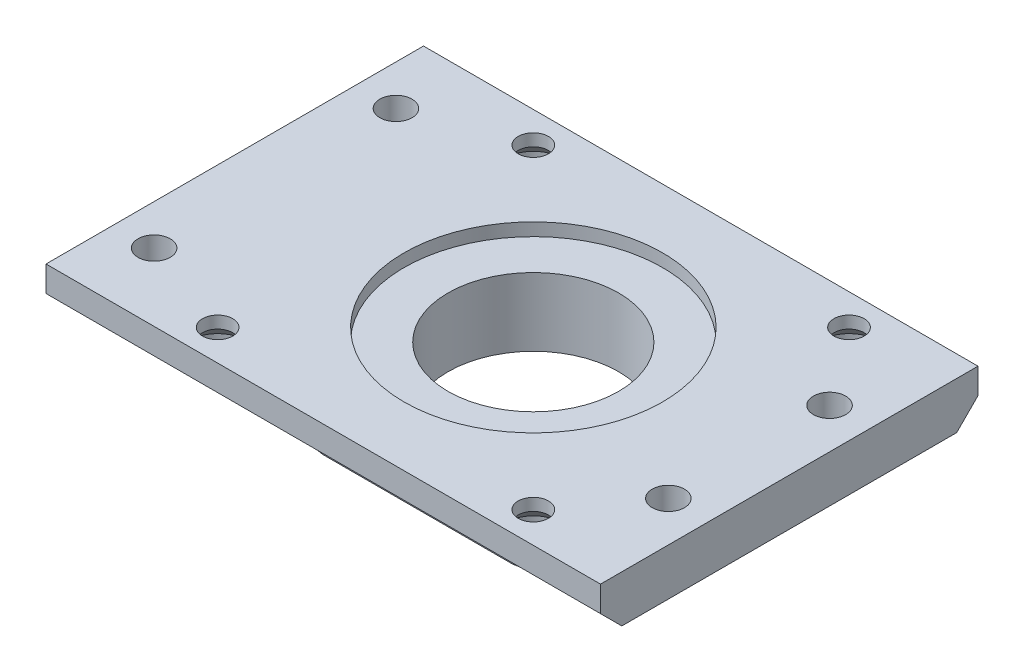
ISO-10303-21;
HEADER;
FILE_DESCRIPTION(('STEP AP214'),'2;1');
FILE_NAME('part.step','',(''),(''),'','','');
FILE_SCHEMA(('AUTOMOTIVE_DESIGN { 1 0 10303 214 1 1 1 1 }'));
ENDSEC;
DATA;
#1=APPLICATION_CONTEXT('core data for automotive mechanical design processes');
#2=APPLICATION_PROTOCOL_DEFINITION('international standard','automotive_design',2000,#1);
#3=PRODUCT_CONTEXT('',#1,'mechanical');
#4=PRODUCT('Part','Part','',(#3));
#5=PRODUCT_RELATED_PRODUCT_CATEGORY('part','',(#4));
#6=PRODUCT_DEFINITION_FORMATION('','',#4);
#7=PRODUCT_DEFINITION_CONTEXT('part definition',#1,'design');
#8=PRODUCT_DEFINITION('design','',#6,#7);
#9=PRODUCT_DEFINITION_SHAPE('','',#8);
#10=(LENGTH_UNIT() NAMED_UNIT(*) SI_UNIT(.MILLI.,.METRE.));
#11=(NAMED_UNIT(*) PLANE_ANGLE_UNIT() SI_UNIT($,.RADIAN.));
#12=(NAMED_UNIT(*) SI_UNIT($,.STERADIAN.) SOLID_ANGLE_UNIT());
#13=UNCERTAINTY_MEASURE_WITH_UNIT(LENGTH_MEASURE(1.E-05),#10,'distance_accuracy_value','');
#14=(GEOMETRIC_REPRESENTATION_CONTEXT(3) GLOBAL_UNCERTAINTY_ASSIGNED_CONTEXT((#13)) GLOBAL_UNIT_ASSIGNED_CONTEXT((#10,
#11,#12)) REPRESENTATION_CONTEXT('',''));
#15=CARTESIAN_POINT('',(0.,0.,0.));
#16=DIRECTION('',(0.,0.,1.));
#17=DIRECTION('',(1.,0.,0.));
#18=AXIS2_PLACEMENT_3D('',#15,#16,#17);
#19=CARTESIAN_POINT('',(-38.1,0.,0.));
#20=DIRECTION('',(0.,1.,0.));
#21=DIRECTION('',(0.,0.,1.));
#22=AXIS2_PLACEMENT_3D('',#19,#20,#21);
#23=CYLINDRICAL_SURFACE('',#22,12.7);
#24=CARTESIAN_POINT('',(-38.1,0.,0.));
#25=DIRECTION('',(0.,1.,0.));
#26=DIRECTION('',(0.,0.,1.));
#27=AXIS2_PLACEMENT_3D('',#24,#25,#26);
#28=CIRCLE('',#27,12.7);
#29=CARTESIAN_POINT('',(-38.1,0.,12.7));
#30=VERTEX_POINT('',#29);
#31=EDGE_CURVE('E222',#30,#30,#28,.T.);
#32=CARTESIAN_POINT('',(-38.1,10.16,0.));
#33=DIRECTION('',(0.,1.,0.));
#34=DIRECTION('',(0.,0.,1.));
#35=AXIS2_PLACEMENT_3D('',#32,#33,#34);
#36=CIRCLE('',#35,12.7);
#37=CARTESIAN_POINT('',(-38.1,10.16,12.7));
#38=VERTEX_POINT('',#37);
#39=EDGE_CURVE('E54',#38,#38,#36,.F.);
#40=CARTESIAN_POINT('',(-38.1,0.,12.7));
#41=CARTESIAN_POINT('',(-38.1,0.105833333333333,12.7));
#42=CARTESIAN_POINT('',(-38.1,0.211666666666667,12.7));
#43=CARTESIAN_POINT('',(-38.1,0.423333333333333,12.7));
#44=CARTESIAN_POINT('',(-38.1,0.529166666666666,12.7));
#45=CARTESIAN_POINT('',(-38.1,0.740833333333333,12.7));
#46=CARTESIAN_POINT('',(-38.1,0.846666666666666,12.7));
#47=CARTESIAN_POINT('',(-38.1,1.05833333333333,12.7));
#48=CARTESIAN_POINT('',(-38.1,1.16416666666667,12.7));
#49=CARTESIAN_POINT('',(-38.1,1.37583333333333,12.7));
#50=CARTESIAN_POINT('',(-38.1,1.48166666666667,12.7));
#51=CARTESIAN_POINT('',(-38.1,1.69333333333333,12.7));
#52=CARTESIAN_POINT('',(-38.1,1.79916666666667,12.7));
#53=CARTESIAN_POINT('',(-38.1,2.01083333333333,12.7));
#54=CARTESIAN_POINT('',(-38.1,2.11666666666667,12.7));
#55=CARTESIAN_POINT('',(-38.1,2.32833333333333,12.7));
#56=CARTESIAN_POINT('',(-38.1,2.43416666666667,12.7));
#57=CARTESIAN_POINT('',(-38.1,2.64583333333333,12.7));
#58=CARTESIAN_POINT('',(-38.1,2.75166666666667,12.7));
#59=CARTESIAN_POINT('',(-38.1,2.96333333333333,12.7));
#60=CARTESIAN_POINT('',(-38.1,3.06916666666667,12.7));
#61=CARTESIAN_POINT('',(-38.1,3.28083333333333,12.7));
#62=CARTESIAN_POINT('',(-38.1,3.38666666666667,12.7));
#63=CARTESIAN_POINT('',(-38.1,3.59833333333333,12.7));
#64=CARTESIAN_POINT('',(-38.1,3.70416666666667,12.7));
#65=CARTESIAN_POINT('',(-38.1,3.91583333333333,12.7));
#66=CARTESIAN_POINT('',(-38.1,4.02166666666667,12.7));
#67=CARTESIAN_POINT('',(-38.1,4.23333333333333,12.7));
#68=CARTESIAN_POINT('',(-38.1,4.33916666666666,12.7));
#69=CARTESIAN_POINT('',(-38.1,4.55083333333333,12.7));
#70=CARTESIAN_POINT('',(-38.1,4.65666666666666,12.7));
#71=CARTESIAN_POINT('',(-38.1,4.86833333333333,12.7));
#72=CARTESIAN_POINT('',(-38.1,4.97416666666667,12.7));
#73=CARTESIAN_POINT('',(-38.1,5.18583333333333,12.7));
#74=CARTESIAN_POINT('',(-38.1,5.29166666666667,12.7));
#75=CARTESIAN_POINT('',(-38.1,5.50333333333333,12.7));
#76=CARTESIAN_POINT('',(-38.1,5.60916666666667,12.7));
#77=CARTESIAN_POINT('',(-38.1,5.82083333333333,12.7));
#78=CARTESIAN_POINT('',(-38.1,5.92666666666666,12.7));
#79=CARTESIAN_POINT('',(-38.1,6.13833333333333,12.7));
#80=CARTESIAN_POINT('',(-38.1,6.24416666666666,12.7));
#81=CARTESIAN_POINT('',(-38.1,6.45583333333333,12.7));
#82=CARTESIAN_POINT('',(-38.1,6.56166666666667,12.7));
#83=CARTESIAN_POINT('',(-38.1,6.77333333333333,12.7));
#84=CARTESIAN_POINT('',(-38.1,6.87916666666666,12.7));
#85=CARTESIAN_POINT('',(-38.1,7.09083333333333,12.7));
#86=CARTESIAN_POINT('',(-38.1,7.19666666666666,12.7));
#87=CARTESIAN_POINT('',(-38.1,7.40833333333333,12.7));
#88=CARTESIAN_POINT('',(-38.1,7.51416666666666,12.7));
#89=CARTESIAN_POINT('',(-38.1,7.72583333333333,12.7));
#90=CARTESIAN_POINT('',(-38.1,7.83166666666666,12.7));
#91=CARTESIAN_POINT('',(-38.1,8.04333333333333,12.7));
#92=CARTESIAN_POINT('',(-38.1,8.14916666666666,12.7));
#93=CARTESIAN_POINT('',(-38.1,8.36083333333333,12.7));
#94=CARTESIAN_POINT('',(-38.1,8.46666666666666,12.7));
#95=CARTESIAN_POINT('',(-38.1,8.67833333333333,12.7));
#96=CARTESIAN_POINT('',(-38.1,8.78416666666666,12.7));
#97=CARTESIAN_POINT('',(-38.1,8.99583333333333,12.7));
#98=CARTESIAN_POINT('',(-38.1,9.10166666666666,12.7));
#99=CARTESIAN_POINT('',(-38.1,9.31333333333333,12.7));
#100=CARTESIAN_POINT('',(-38.1,9.41916666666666,12.7));
#101=CARTESIAN_POINT('',(-38.1,9.63083333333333,12.7));
#102=CARTESIAN_POINT('',(-38.1,9.73666666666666,12.7));
#103=CARTESIAN_POINT('',(-38.1,9.94833333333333,12.7));
#104=CARTESIAN_POINT('',(-38.1,10.0541666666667,12.7));
#105=CARTESIAN_POINT('',(-38.1,10.16,12.7));
#106=B_SPLINE_CURVE_WITH_KNOTS('',3,(#40,#41,#42,#43,#44,#45,#46,#47,#48,#49,#50,#51,#52,#53,
#54,#55,#56,#57,#58,#59,#60,#61,#62,#63,#64,#65,#66,#67,#68,#69,#70,#71,#72,#73,#74,#75,#76,#77,
#78,#79,#80,#81,#82,#83,#84,#85,#86,#87,#88,#89,#90,#91,#92,#93,#94,#95,#96,#97,#98,#99,#100,
#101,#102,#103,#104,#105),.UNSPECIFIED.,.F.,.F.,(4,2,2,2,2,2,2,2,2,2,2,2,2,2,2,2,2,2,2,2,2,2,2,
2,2,2,2,2,2,2,2,2,4),(0.,0.3175,0.635,0.9525,1.27,1.5875,1.905,2.2225,2.54,2.8575,3.175,3.4925,
3.81,4.1275,4.445,4.7625,5.08,5.3975,5.715,6.0325,6.35,6.6675,6.985,7.3025,7.62,7.9375,8.255,
8.5725,8.89,9.2075,9.525,9.8425,10.16),.UNSPECIFIED.);
#107=EDGE_CURVE('BSEAM49',#30,#38,#106,.T.);
#108=ORIENTED_EDGE('',*,*,#31,.F.);
#109=ORIENTED_EDGE('',*,*,#39,.F.);
#110=ORIENTED_EDGE('',*,*,#107,.T.);
#111=ORIENTED_EDGE('',*,*,#107,.F.);
#112=EDGE_LOOP('',(#108,#110,#109,#111));
#113=FACE_BOUND('',#112,.T.);
#114=ADVANCED_FACE('F49',(#113),#23,.F.);
#115=CARTESIAN_POINT('',(0.,12.065,-28.1));
#116=DIRECTION('',(-1.,0.,0.));
#117=DIRECTION('',(0.,0.,1.));
#118=AXIS2_PLACEMENT_3D('',#115,#116,#117);
#119=PLANE('',#118);
#120=DIRECTION('',(0.,-1.,0.));
#121=VECTOR('',#120,1.);
#122=CARTESIAN_POINT('',(0.,12.065,28.1));
#123=LINE('',#122,#121);
#124=CARTESIAN_POINT('',(0.,12.065,28.1));
#125=VERTEX_POINT('',#124);
#126=CARTESIAN_POINT('',(0.,8.255,28.1));
#127=VERTEX_POINT('',#126);
#128=EDGE_CURVE('E381',#125,#127,#123,.T.);
#129=ORIENTED_EDGE('',*,*,#128,.T.);
#130=DIRECTION('',(0.,-0.707106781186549,-0.707106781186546));
#131=VECTOR('',#130,1.);
#132=CARTESIAN_POINT('',(0.,5.08,24.925));
#133=LINE('',#132,#131);
#134=CARTESIAN_POINT('',(0.,5.08,24.925));
#135=VERTEX_POINT('',#134);
#136=EDGE_CURVE('E346',#127,#135,#133,.T.);
#137=ORIENTED_EDGE('',*,*,#136,.T.);
#138=DIRECTION('',(0.,0.,1.));
#139=VECTOR('',#138,1.);
#140=CARTESIAN_POINT('',(0.,5.08,0.));
#141=LINE('',#140,#139);
#142=CARTESIAN_POINT('',(0.,5.08,-24.925));
#143=VERTEX_POINT('',#142);
#144=EDGE_CURVE('E393',#143,#135,#141,.T.);
#145=ORIENTED_EDGE('',*,*,#144,.F.);
#146=DIRECTION('',(0.,0.707106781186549,-0.707106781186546));
#147=VECTOR('',#146,1.);
#148=CARTESIAN_POINT('',(0.,5.08,-24.925));
#149=LINE('',#148,#147);
#150=CARTESIAN_POINT('',(0.,8.25500000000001,-28.1));
#151=VERTEX_POINT('',#150);
#152=EDGE_CURVE('E67',#143,#151,#149,.T.);
#153=ORIENTED_EDGE('',*,*,#152,.T.);
#154=DIRECTION('',(0.,-1.,0.));
#155=VECTOR('',#154,1.);
#156=CARTESIAN_POINT('',(0.,12.065,-28.1));
#157=LINE('',#156,#155);
#158=CARTESIAN_POINT('',(0.,12.065,-28.1));
#159=VERTEX_POINT('',#158);
#160=EDGE_CURVE('E206',#159,#151,#157,.T.);
#161=ORIENTED_EDGE('',*,*,#160,.F.);
#162=DIRECTION('',(0.,0.,-1.));
#163=VECTOR('',#162,1.);
#164=CARTESIAN_POINT('',(0.,12.065,-28.1));
#165=LINE('',#164,#163);
#166=EDGE_CURVE('E214',#125,#159,#165,.T.);
#167=ORIENTED_EDGE('',*,*,#166,.F.);
#168=EDGE_LOOP('',(#129,#137,#145,#153,#161,#167));
#169=FACE_BOUND('',#168,.T.);
#170=ADVANCED_FACE('F224',(#169),#119,.F.);
#171=CARTESIAN_POINT('',(0.,12.065,-28.1));
#172=DIRECTION('',(0.,0.,1.));
#173=DIRECTION('',(1.,0.,0.));
#174=AXIS2_PLACEMENT_3D('',#171,#172,#173);
#175=PLANE('',#174);
#176=ORIENTED_EDGE('',*,*,#160,.T.);
#177=DIRECTION('',(-1.,0.,0.));
#178=VECTOR('',#177,1.);
#179=CARTESIAN_POINT('',(-82.55,8.25500000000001,-28.1));
#180=LINE('',#179,#178);
#181=CARTESIAN_POINT('',(-82.55,8.25500000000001,-28.1));
#182=VERTEX_POINT('',#181);
#183=EDGE_CURVE('E11',#151,#182,#180,.T.);
#184=ORIENTED_EDGE('',*,*,#183,.T.);
#185=DIRECTION('',(0.,-1.,0.));
#186=VECTOR('',#185,1.);
#187=CARTESIAN_POINT('',(-82.55,12.065,-28.1));
#188=LINE('',#187,#186);
#189=CARTESIAN_POINT('',(-82.55,12.065,-28.1));
#190=VERTEX_POINT('',#189);
#191=EDGE_CURVE('E209',#190,#182,#188,.T.);
#192=ORIENTED_EDGE('',*,*,#191,.F.);
#193=DIRECTION('',(-1.,0.,0.));
#194=VECTOR('',#193,1.);
#195=CARTESIAN_POINT('',(0.,12.065,-28.1));
#196=LINE('',#195,#194);
#197=EDGE_CURVE('E203',#159,#190,#196,.T.);
#198=ORIENTED_EDGE('',*,*,#197,.F.);
#199=EDGE_LOOP('',(#176,#184,#192,#198));
#200=FACE_BOUND('',#199,.T.);
#201=ADVANCED_FACE('F205',(#200),#175,.F.);
#202=CARTESIAN_POINT('',(-82.55,12.065,-28.1));
#203=DIRECTION('',(1.,0.,0.));
#204=DIRECTION('',(0.,0.,-1.));
#205=AXIS2_PLACEMENT_3D('',#202,#203,#204);
#206=PLANE('',#205);
#207=DIRECTION('',(0.,0.,-1.));
#208=VECTOR('',#207,1.);
#209=CARTESIAN_POINT('',(-82.55,5.08,0.));
#210=LINE('',#209,#208);
#211=CARTESIAN_POINT('',(-82.55,5.08,24.9250000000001));
#212=VERTEX_POINT('',#211);
#213=CARTESIAN_POINT('',(-82.55,5.08,-24.925));
#214=VERTEX_POINT('',#213);
#215=EDGE_CURVE('E397',#212,#214,#210,.T.);
#216=ORIENTED_EDGE('',*,*,#215,.F.);
#217=DIRECTION('',(0.,0.707106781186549,0.707106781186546));
#218=VECTOR('',#217,1.);
#219=CARTESIAN_POINT('',(-82.55,5.07999999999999,24.925));
#220=LINE('',#219,#218);
#221=CARTESIAN_POINT('',(-82.55,8.255,28.1));
#222=VERTEX_POINT('',#221);
#223=EDGE_CURVE('E339',#212,#222,#220,.T.);
#224=ORIENTED_EDGE('',*,*,#223,.T.);
#225=DIRECTION('',(0.,-1.,0.));
#226=VECTOR('',#225,1.);
#227=CARTESIAN_POINT('',(-82.55,12.065,28.1));
#228=LINE('',#227,#226);
#229=CARTESIAN_POINT('',(-82.55,12.065,28.1));
#230=VERTEX_POINT('',#229);
#231=EDGE_CURVE('E232',#230,#222,#228,.T.);
#232=ORIENTED_EDGE('',*,*,#231,.F.);
#233=DIRECTION('',(0.,0.,1.));
#234=VECTOR('',#233,1.);
#235=CARTESIAN_POINT('',(-82.55,12.065,-28.1));
#236=LINE('',#235,#234);
#237=EDGE_CURVE('E213',#190,#230,#236,.T.);
#238=ORIENTED_EDGE('',*,*,#237,.F.);
#239=ORIENTED_EDGE('',*,*,#191,.T.);
#240=DIRECTION('',(0.,-0.707106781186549,0.707106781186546));
#241=VECTOR('',#240,1.);
#242=CARTESIAN_POINT('',(-82.55,5.07999999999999,-24.925));
#243=LINE('',#242,#241);
#244=EDGE_CURVE('E336',#182,#214,#243,.T.);
#245=ORIENTED_EDGE('',*,*,#244,.T.);
#246=EDGE_LOOP('',(#216,#224,#232,#238,#239,#245));
#247=FACE_BOUND('',#246,.T.);
#248=ADVANCED_FACE('F375',(#247),#206,.F.);
#249=CARTESIAN_POINT('',(0.,12.065,28.1));
#250=DIRECTION('',(0.,0.,-1.));
#251=DIRECTION('',(-1.,0.,0.));
#252=AXIS2_PLACEMENT_3D('',#249,#250,#251);
#253=PLANE('',#252);
#254=ORIENTED_EDGE('',*,*,#231,.T.);
#255=DIRECTION('',(1.,0.,0.));
#256=VECTOR('',#255,1.);
#257=CARTESIAN_POINT('',(0.,8.255,28.1));
#258=LINE('',#257,#256);
#259=EDGE_CURVE('E75',#222,#127,#258,.T.);
#260=ORIENTED_EDGE('',*,*,#259,.T.);
#261=ORIENTED_EDGE('',*,*,#128,.F.);
#262=DIRECTION('',(1.,0.,0.));
#263=VECTOR('',#262,1.);
#264=CARTESIAN_POINT('',(0.,12.065,28.1));
#265=LINE('',#264,#263);
#266=EDGE_CURVE('E220',#230,#125,#265,.T.);
#267=ORIENTED_EDGE('',*,*,#266,.F.);
#268=EDGE_LOOP('',(#254,#260,#261,#267));
#269=FACE_BOUND('',#268,.T.);
#270=ADVANCED_FACE('F386',(#269),#253,.F.);
#271=CARTESIAN_POINT('',(0.,0.,0.));
#272=DIRECTION('',(0.,-1.,0.));
#273=DIRECTION('',(0.,0.,-1.));
#274=AXIS2_PLACEMENT_3D('',#271,#272,#273);
#275=PLANE('',#274);
#276=ORIENTED_EDGE('',*,*,#31,.T.);
#277=EDGE_LOOP('',(#276));
#278=FACE_BOUND('',#277,.T.);
#279=DIRECTION('',(0.984807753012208,0.,-0.173648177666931));
#280=VECTOR('',#279,1.);
#281=CARTESIAN_POINT('',(-4.91237982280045,0.,-27.859490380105));
#282=LINE('',#281,#280);
#283=CARTESIAN_POINT('',(-69.5749862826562,0.,-16.4577282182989));
#284=VERTEX_POINT('',#283);
#285=CARTESIAN_POINT('',(-49.7702634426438,0.,-19.9498352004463));
#286=VERTEX_POINT('',#285);
#287=EDGE_CURVE('E417',#284,#286,#282,.T.);
#288=ORIENTED_EDGE('',*,*,#287,.T.);
#289=CARTESIAN_POINT('',(-49.1968771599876,0.,-16.698));
#290=DIRECTION('',(0.,-1.,0.));
#291=DIRECTION('',(0.,0.,-1.));
#292=AXIS2_PLACEMENT_3D('',#289,#290,#291);
#293=CIRCLE('',#292,3.302);
#294=CARTESIAN_POINT('',(-49.1968771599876,0.,-20.));
#295=VERTEX_POINT('',#294);
#296=EDGE_CURVE('E254',#286,#295,#293,.T.);
#297=ORIENTED_EDGE('',*,*,#296,.T.);
#298=DIRECTION('',(-1.,0.,0.));
#299=VECTOR('',#298,1.);
#300=CARTESIAN_POINT('',(0.,0.,-20.));
#301=LINE('',#300,#299);
#302=CARTESIAN_POINT('',(-21.402,0.,-20.));
#303=VERTEX_POINT('',#302);
#304=EDGE_CURVE('E437',#303,#295,#301,.T.);
#305=ORIENTED_EDGE('',*,*,#304,.F.);
#306=CARTESIAN_POINT('',(-21.402,0.,-16.698));
#307=DIRECTION('',(0.,-1.,0.));
#308=DIRECTION('',(0.,0.,-1.));
#309=AXIS2_PLACEMENT_3D('',#306,#307,#308);
#310=CIRCLE('',#309,3.302);
#311=CARTESIAN_POINT('',(-18.1,0.,-16.698));
#312=VERTEX_POINT('',#311);
#313=EDGE_CURVE('E242',#303,#312,#310,.T.);
#314=ORIENTED_EDGE('',*,*,#313,.T.);
#315=DIRECTION('',(0.,0.,-1.));
#316=VECTOR('',#315,1.);
#317=CARTESIAN_POINT('',(-18.1,0.,0.));
#318=LINE('',#317,#316);
#319=CARTESIAN_POINT('',(-18.1,0.,16.698));
#320=VERTEX_POINT('',#319);
#321=EDGE_CURVE('E433',#320,#312,#318,.T.);
#322=ORIENTED_EDGE('',*,*,#321,.F.);
#323=CARTESIAN_POINT('',(-21.402,0.,16.698));
#324=DIRECTION('',(0.,-1.,0.));
#325=DIRECTION('',(0.,0.,-1.));
#326=AXIS2_PLACEMENT_3D('',#323,#324,#325);
#327=CIRCLE('',#326,3.302);
#328=CARTESIAN_POINT('',(-21.402,0.,20.));
#329=VERTEX_POINT('',#328);
#330=EDGE_CURVE('E239',#320,#329,#327,.T.);
#331=ORIENTED_EDGE('',*,*,#330,.T.);
#332=DIRECTION('',(1.,0.,0.));
#333=VECTOR('',#332,1.);
#334=CARTESIAN_POINT('',(0.,0.,20.));
#335=LINE('',#334,#333);
#336=CARTESIAN_POINT('',(-49.1968771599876,0.,20.));
#337=VERTEX_POINT('',#336);
#338=EDGE_CURVE('E429',#337,#329,#335,.T.);
#339=ORIENTED_EDGE('',*,*,#338,.F.);
#340=CARTESIAN_POINT('',(-49.1968771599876,0.,16.698));
#341=DIRECTION('',(0.,-1.,0.));
#342=DIRECTION('',(0.,0.,-1.));
#343=AXIS2_PLACEMENT_3D('',#340,#341,#342);
#344=CIRCLE('',#343,3.302);
#345=CARTESIAN_POINT('',(-49.7702634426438,0.,19.9498352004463));
#346=VERTEX_POINT('',#345);
#347=EDGE_CURVE('E248',#337,#346,#344,.T.);
#348=ORIENTED_EDGE('',*,*,#347,.T.);
#349=DIRECTION('',(0.984807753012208,0.,0.173648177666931));
#350=VECTOR('',#349,1.);
#351=CARTESIAN_POINT('',(-4.91237982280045,0.,27.859490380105));
#352=LINE('',#351,#350);
#353=CARTESIAN_POINT('',(-69.5749862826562,0.,16.4577282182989));
#354=VERTEX_POINT('',#353);
#355=EDGE_CURVE('E425',#354,#346,#352,.T.);
#356=ORIENTED_EDGE('',*,*,#355,.F.);
#357=CARTESIAN_POINT('',(-69.0016,0.,13.2058930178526));
#358=DIRECTION('',(0.,-1.,0.));
#359=DIRECTION('',(0.,0.,-1.));
#360=AXIS2_PLACEMENT_3D('',#357,#358,#359);
#361=CIRCLE('',#360,3.302);
#362=CARTESIAN_POINT('',(-72.3036,0.,13.2058930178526));
#363=VERTEX_POINT('',#362);
#364=EDGE_CURVE('E245',#354,#363,#361,.T.);
#365=ORIENTED_EDGE('',*,*,#364,.T.);
#366=DIRECTION('',(0.,0.,-1.));
#367=VECTOR('',#366,1.);
#368=CARTESIAN_POINT('',(-72.3036,0.,0.));
#369=LINE('',#368,#367);
#370=CARTESIAN_POINT('',(-72.3036,0.,-13.2058930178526));
#371=VERTEX_POINT('',#370);
#372=EDGE_CURVE('E421',#363,#371,#369,.T.);
#373=ORIENTED_EDGE('',*,*,#372,.T.);
#374=CARTESIAN_POINT('',(-69.0016,0.,-13.2058930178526));
#375=DIRECTION('',(0.,-1.,0.));
#376=DIRECTION('',(0.,0.,-1.));
#377=AXIS2_PLACEMENT_3D('',#374,#375,#376);
#378=CIRCLE('',#377,3.302);
#379=EDGE_CURVE('E251',#371,#284,#378,.T.);
#380=ORIENTED_EDGE('',*,*,#379,.T.);
#381=EDGE_LOOP('',(#288,#297,#305,#314,#322,#331,#339,#348,#356,#365,#373,#380));
#382=FACE_BOUND('',#381,.T.);
#383=ADVANCED_FACE('F509',(#278,#382),#275,.T.);
#384=CARTESIAN_POINT('',(-61.6,0.,-23.5));
#385=DIRECTION('',(0.,-1.,0.));
#386=DIRECTION('',(0.,0.,-1.));
#387=AXIS2_PLACEMENT_3D('',#384,#385,#386);
#388=CYLINDRICAL_SURFACE('',#387,4.25);
#389=CARTESIAN_POINT('',(-61.6,8.255,-23.5));
#390=DIRECTION('',(0.,-1.,0.));
#391=DIRECTION('',(0.,0.,-1.));
#392=AXIS2_PLACEMENT_3D('',#389,#390,#391);
#393=CIRCLE('',#392,4.25);
#394=CARTESIAN_POINT('',(-61.6,8.255,-27.75));
#395=VERTEX_POINT('',#394);
#396=EDGE_CURVE('E493',#395,#395,#393,.T.);
#397=ORIENTED_EDGE('',*,*,#396,.F.);
#398=EDGE_LOOP('',(#397));
#399=FACE_BOUND('',#398,.T.);
#400=CARTESIAN_POINT('',(-61.6,5.08,-23.5));
#401=DIRECTION('',(0.,-1.,0.));
#402=DIRECTION('',(0.,0.,-1.));
#403=AXIS2_PLACEMENT_3D('',#400,#401,#402);
#404=CIRCLE('',#403,4.25);
#405=CARTESIAN_POINT('',(-65.6039823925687,5.08,-24.925));
#406=VERTEX_POINT('',#405);
#407=CARTESIAN_POINT('',(-57.5960176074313,5.08,-24.925));
#408=VERTEX_POINT('',#407);
#409=EDGE_CURVE('E398',#406,#408,#404,.F.);
#410=ORIENTED_EDGE('',*,*,#409,.F.);
#411=CARTESIAN_POINT('',(-61.6,3.65499999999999,-23.5));
#412=DIRECTION('',(0.,-0.707106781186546,-0.707106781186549));
#413=DIRECTION('',(0.,-0.707106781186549,0.707106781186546));
#414=AXIS2_PLACEMENT_3D('',#411,#412,#413);
#415=ELLIPSE('',#414,6.01040764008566,4.25);
#416=EDGE_CURVE('E349',#406,#408,#415,.T.);
#417=ORIENTED_EDGE('',*,*,#416,.T.);
#418=EDGE_LOOP('',(#410,#417));
#419=FACE_BOUND('',#418,.T.);
#420=ADVANCED_FACE('F578',(#399,#419),#388,.F.);
#421=CARTESIAN_POINT('',(-14.6,0.,23.5));
#422=DIRECTION('',(0.,-1.,0.));
#423=DIRECTION('',(0.,0.,-1.));
#424=AXIS2_PLACEMENT_3D('',#421,#422,#423);
#425=CYLINDRICAL_SURFACE('',#424,4.25);
#426=CARTESIAN_POINT('',(-14.6,8.255,23.5));
#427=DIRECTION('',(0.,-1.,0.));
#428=DIRECTION('',(0.,0.,-1.));
#429=AXIS2_PLACEMENT_3D('',#426,#427,#428);
#430=CIRCLE('',#429,4.25);
#431=CARTESIAN_POINT('',(-14.6,8.255,19.25));
#432=VERTEX_POINT('',#431);
#433=EDGE_CURVE('E481',#432,#432,#430,.T.);
#434=ORIENTED_EDGE('',*,*,#433,.F.);
#435=EDGE_LOOP('',(#434));
#436=FACE_BOUND('',#435,.T.);
#437=CARTESIAN_POINT('',(-14.6,5.08,23.5));
#438=DIRECTION('',(0.,-1.,0.));
#439=DIRECTION('',(0.,0.,-1.));
#440=AXIS2_PLACEMENT_3D('',#437,#438,#439);
#441=CIRCLE('',#440,4.25);
#442=CARTESIAN_POINT('',(-10.5960176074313,5.08,24.925));
#443=VERTEX_POINT('',#442);
#444=CARTESIAN_POINT('',(-18.6039823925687,5.08,24.925));
#445=VERTEX_POINT('',#444);
#446=EDGE_CURVE('E369',#443,#445,#441,.F.);
#447=ORIENTED_EDGE('',*,*,#446,.F.);
#448=CARTESIAN_POINT('',(-14.6,3.65499999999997,23.5));
#449=DIRECTION('',(0.,-0.707106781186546,0.707106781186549));
#450=DIRECTION('',(0.,-0.707106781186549,-0.707106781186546));
#451=AXIS2_PLACEMENT_3D('',#448,#449,#450);
#452=ELLIPSE('',#451,6.01040764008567,4.25);
#453=EDGE_CURVE('E330',#443,#445,#452,.T.);
#454=ORIENTED_EDGE('',*,*,#453,.T.);
#455=EDGE_LOOP('',(#447,#454));
#456=FACE_BOUND('',#455,.T.);
#457=ADVANCED_FACE('F568',(#436,#456),#425,.F.);
#458=CARTESIAN_POINT('',(-61.6,0.,23.5));
#459=DIRECTION('',(0.,-1.,0.));
#460=DIRECTION('',(0.,0.,-1.));
#461=AXIS2_PLACEMENT_3D('',#458,#459,#460);
#462=CYLINDRICAL_SURFACE('',#461,4.25);
#463=CARTESIAN_POINT('',(-61.6,8.255,23.5));
#464=DIRECTION('',(0.,-1.,0.));
#465=DIRECTION('',(0.,0.,-1.));
#466=AXIS2_PLACEMENT_3D('',#463,#464,#465);
#467=CIRCLE('',#466,4.25);
#468=CARTESIAN_POINT('',(-61.6,8.255,19.25));
#469=VERTEX_POINT('',#468);
#470=EDGE_CURVE('E469',#469,#469,#467,.T.);
#471=ORIENTED_EDGE('',*,*,#470,.F.);
#472=EDGE_LOOP('',(#471));
#473=FACE_BOUND('',#472,.T.);
#474=CARTESIAN_POINT('',(-61.6,5.08,23.5));
#475=DIRECTION('',(0.,-1.,0.));
#476=DIRECTION('',(0.,0.,-1.));
#477=AXIS2_PLACEMENT_3D('',#474,#475,#476);
#478=CIRCLE('',#477,4.25);
#479=CARTESIAN_POINT('',(-57.5960176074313,5.08,24.925));
#480=VERTEX_POINT('',#479);
#481=CARTESIAN_POINT('',(-65.6039823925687,5.08,24.9250000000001));
#482=VERTEX_POINT('',#481);
#483=EDGE_CURVE('E403',#480,#482,#478,.F.);
#484=ORIENTED_EDGE('',*,*,#483,.F.);
#485=CARTESIAN_POINT('',(-61.6,3.65499999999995,23.5));
#486=DIRECTION('',(0.,-0.707106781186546,0.707106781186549));
#487=DIRECTION('',(0.,-0.707106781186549,-0.707106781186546));
#488=AXIS2_PLACEMENT_3D('',#485,#486,#487);
#489=ELLIPSE('',#488,6.01040764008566,4.25);
#490=EDGE_CURVE('E333',#480,#482,#489,.T.);
#491=ORIENTED_EDGE('',*,*,#490,.T.);
#492=EDGE_LOOP('',(#484,#491));
#493=FACE_BOUND('',#492,.T.);
#494=ADVANCED_FACE('F566',(#473,#493),#462,.F.);
#495=CARTESIAN_POINT('',(-14.6,0.,-23.5));
#496=DIRECTION('',(0.,-1.,0.));
#497=DIRECTION('',(0.,0.,-1.));
#498=AXIS2_PLACEMENT_3D('',#495,#496,#497);
#499=CYLINDRICAL_SURFACE('',#498,4.25);
#500=CARTESIAN_POINT('',(-14.6,8.255,-23.5));
#501=DIRECTION('',(0.,-1.,0.));
#502=DIRECTION('',(0.,0.,-1.));
#503=AXIS2_PLACEMENT_3D('',#500,#501,#502);
#504=CIRCLE('',#503,4.25);
#505=CARTESIAN_POINT('',(-14.6,8.255,-27.75));
#506=VERTEX_POINT('',#505);
#507=EDGE_CURVE('E457',#506,#506,#504,.T.);
#508=ORIENTED_EDGE('',*,*,#507,.F.);
#509=EDGE_LOOP('',(#508));
#510=FACE_BOUND('',#509,.T.);
#511=CARTESIAN_POINT('',(-14.6,5.08,-23.5));
#512=DIRECTION('',(0.,-1.,0.));
#513=DIRECTION('',(0.,0.,-1.));
#514=AXIS2_PLACEMENT_3D('',#511,#512,#513);
#515=CIRCLE('',#514,4.25);
#516=CARTESIAN_POINT('',(-18.6039823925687,5.08,-24.925));
#517=VERTEX_POINT('',#516);
#518=CARTESIAN_POINT('',(-10.5960176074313,5.08,-24.925));
#519=VERTEX_POINT('',#518);
#520=EDGE_CURVE('E358',#517,#519,#515,.F.);
#521=ORIENTED_EDGE('',*,*,#520,.F.);
#522=CARTESIAN_POINT('',(-14.6,3.65499999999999,-23.5));
#523=DIRECTION('',(0.,-0.707106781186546,-0.707106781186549));
#524=DIRECTION('',(0.,-0.707106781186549,0.707106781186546));
#525=AXIS2_PLACEMENT_3D('',#522,#523,#524);
#526=ELLIPSE('',#525,6.01040764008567,4.25);
#527=EDGE_CURVE('E60',#517,#519,#526,.T.);
#528=ORIENTED_EDGE('',*,*,#527,.T.);
#529=EDGE_LOOP('',(#521,#528));
#530=FACE_BOUND('',#529,.T.);
#531=ADVANCED_FACE('F357',(#510,#530),#499,.F.);
#532=CARTESIAN_POINT('',(-5.99999999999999,12.065,-12.));
#533=DIRECTION('',(0.,1.,0.));
#534=DIRECTION('',(0.,0.,1.));
#535=AXIS2_PLACEMENT_3D('',#532,#533,#534);
#536=CYLINDRICAL_SURFACE('',#535,2.4);
#537=CARTESIAN_POINT('',(-5.99999999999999,12.065,-12.));
#538=DIRECTION('',(0.,1.,0.));
#539=DIRECTION('',(0.,0.,1.));
#540=AXIS2_PLACEMENT_3D('',#537,#538,#539);
#541=CIRCLE('',#540,2.4);
#542=CARTESIAN_POINT('',(-5.99999999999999,12.065,-9.6));
#543=VERTEX_POINT('',#542);
#544=EDGE_CURVE('E453',#543,#543,#541,.T.);
#545=ORIENTED_EDGE('',*,*,#544,.T.);
#546=EDGE_LOOP('',(#545));
#547=FACE_BOUND('',#546,.T.);
#548=CARTESIAN_POINT('',(-5.99999999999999,5.08,-12.));
#549=DIRECTION('',(0.,-1.,0.));
#550=DIRECTION('',(0.,0.,-1.));
#551=AXIS2_PLACEMENT_3D('',#548,#549,#550);
#552=CIRCLE('',#551,2.4);
#553=CARTESIAN_POINT('',(-5.99999999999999,5.08,-14.4));
#554=VERTEX_POINT('',#553);
#555=EDGE_CURVE('E557',#554,#554,#552,.F.);
#556=ORIENTED_EDGE('',*,*,#555,.F.);
#557=EDGE_LOOP('',(#556));
#558=FACE_BOUND('',#557,.T.);
#559=ADVANCED_FACE('F575',(#547,#558),#536,.F.);
#560=CARTESIAN_POINT('',(-76.55,12.065,-18.));
#561=DIRECTION('',(0.,1.,0.));
#562=DIRECTION('',(0.,0.,1.));
#563=AXIS2_PLACEMENT_3D('',#560,#561,#562);
#564=CYLINDRICAL_SURFACE('',#563,2.4);
#565=CARTESIAN_POINT('',(-76.55,12.065,-18.));
#566=DIRECTION('',(0.,1.,0.));
#567=DIRECTION('',(0.,0.,1.));
#568=AXIS2_PLACEMENT_3D('',#565,#566,#567);
#569=CIRCLE('',#568,2.4);
#570=CARTESIAN_POINT('',(-76.55,12.065,-15.6));
#571=VERTEX_POINT('',#570);
#572=EDGE_CURVE('E449',#571,#571,#569,.T.);
#573=ORIENTED_EDGE('',*,*,#572,.T.);
#574=EDGE_LOOP('',(#573));
#575=FACE_BOUND('',#574,.T.);
#576=CARTESIAN_POINT('',(-76.55,5.08,-18.));
#577=DIRECTION('',(0.,-1.,0.));
#578=DIRECTION('',(0.,0.,-1.));
#579=AXIS2_PLACEMENT_3D('',#576,#577,#578);
#580=CIRCLE('',#579,2.4);
#581=CARTESIAN_POINT('',(-76.55,5.08,-20.4));
#582=VERTEX_POINT('',#581);
#583=EDGE_CURVE('E368',#582,#582,#580,.F.);
#584=ORIENTED_EDGE('',*,*,#583,.F.);
#585=EDGE_LOOP('',(#584));
#586=FACE_BOUND('',#585,.T.);
#587=ADVANCED_FACE('F703',(#575,#586),#564,.F.);
#588=CARTESIAN_POINT('',(-5.99999999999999,12.065,12.));
#589=DIRECTION('',(0.,1.,0.));
#590=DIRECTION('',(0.,0.,1.));
#591=AXIS2_PLACEMENT_3D('',#588,#589,#590);
#592=CYLINDRICAL_SURFACE('',#591,2.4);
#593=CARTESIAN_POINT('',(-5.99999999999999,12.065,12.));
#594=DIRECTION('',(0.,1.,0.));
#595=DIRECTION('',(0.,0.,1.));
#596=AXIS2_PLACEMENT_3D('',#593,#594,#595);
#597=CIRCLE('',#596,2.4);
#598=CARTESIAN_POINT('',(-5.99999999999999,12.065,14.4));
#599=VERTEX_POINT('',#598);
#600=EDGE_CURVE('E445',#599,#599,#597,.T.);
#601=ORIENTED_EDGE('',*,*,#600,.T.);
#602=EDGE_LOOP('',(#601));
#603=FACE_BOUND('',#602,.T.);
#604=CARTESIAN_POINT('',(-5.99999999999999,5.08,12.));
#605=DIRECTION('',(0.,-1.,0.));
#606=DIRECTION('',(0.,0.,-1.));
#607=AXIS2_PLACEMENT_3D('',#604,#605,#606);
#608=CIRCLE('',#607,2.4);
#609=CARTESIAN_POINT('',(-5.99999999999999,5.08,9.6));
#610=VERTEX_POINT('',#609);
#611=EDGE_CURVE('E553',#610,#610,#608,.F.);
#612=ORIENTED_EDGE('',*,*,#611,.F.);
#613=EDGE_LOOP('',(#612));
#614=FACE_BOUND('',#613,.T.);
#615=ADVANCED_FACE('F699',(#603,#614),#592,.F.);
#616=CARTESIAN_POINT('',(-76.55,12.065,18.));
#617=DIRECTION('',(0.,1.,0.));
#618=DIRECTION('',(0.,0.,1.));
#619=AXIS2_PLACEMENT_3D('',#616,#617,#618);
#620=CYLINDRICAL_SURFACE('',#619,2.4);
#621=CARTESIAN_POINT('',(-76.55,12.065,18.));
#622=DIRECTION('',(0.,1.,0.));
#623=DIRECTION('',(0.,0.,1.));
#624=AXIS2_PLACEMENT_3D('',#621,#622,#623);
#625=CIRCLE('',#624,2.4);
#626=CARTESIAN_POINT('',(-76.55,12.065,20.4));
#627=VERTEX_POINT('',#626);
#628=EDGE_CURVE('E416',#627,#627,#625,.T.);
#629=ORIENTED_EDGE('',*,*,#628,.T.);
#630=EDGE_LOOP('',(#629));
#631=FACE_BOUND('',#630,.T.);
#632=CARTESIAN_POINT('',(-76.55,5.08,18.));
#633=DIRECTION('',(0.,-1.,0.));
#634=DIRECTION('',(0.,0.,-1.));
#635=AXIS2_PLACEMENT_3D('',#632,#633,#634);
#636=CIRCLE('',#635,2.4);
#637=CARTESIAN_POINT('',(-76.55,5.08,15.6));
#638=VERTEX_POINT('',#637);
#639=EDGE_CURVE('E412',#638,#638,#636,.F.);
#640=ORIENTED_EDGE('',*,*,#639,.F.);
#641=EDGE_LOOP('',(#640));
#642=FACE_BOUND('',#641,.T.);
#643=ADVANCED_FACE('F615',(#631,#642),#620,.F.);
#644=CARTESIAN_POINT('',(0.,12.065,0.));
#645=DIRECTION('',(0.,-1.,0.));
#646=DIRECTION('',(0.,0.,-1.));
#647=AXIS2_PLACEMENT_3D('',#644,#645,#646);
#648=PLANE('',#647);
#649=CARTESIAN_POINT('',(-38.1,12.065,0.));
#650=DIRECTION('',(0.,1.,0.));
#651=DIRECTION('',(0.,0.,1.));
#652=AXIS2_PLACEMENT_3D('',#649,#650,#651);
#653=CIRCLE('',#652,19.2405);
#654=CARTESIAN_POINT('',(-38.1,12.065,19.2405));
#655=VERTEX_POINT('',#654);
#656=EDGE_CURVE('E522',#655,#655,#653,.T.);
#657=ORIENTED_EDGE('',*,*,#656,.F.);
#658=EDGE_LOOP('',(#657));
#659=FACE_BOUND('',#658,.T.);
#660=ORIENTED_EDGE('',*,*,#572,.F.);
#661=EDGE_LOOP('',(#660));
#662=FACE_BOUND('',#661,.T.);
#663=ORIENTED_EDGE('',*,*,#544,.F.);
#664=EDGE_LOOP('',(#663));
#665=FACE_BOUND('',#664,.T.);
#666=CARTESIAN_POINT('',(-14.6,12.065,-23.5));
#667=DIRECTION('',(0.,-1.,0.));
#668=DIRECTION('',(0.,0.,-1.));
#669=AXIS2_PLACEMENT_3D('',#666,#667,#668);
#670=CIRCLE('',#669,2.25);
#671=CARTESIAN_POINT('',(-14.6,12.065,-25.75));
#672=VERTEX_POINT('',#671);
#673=EDGE_CURVE('E465',#672,#672,#670,.T.);
#674=ORIENTED_EDGE('',*,*,#673,.T.);
#675=EDGE_LOOP('',(#674));
#676=FACE_BOUND('',#675,.T.);
#677=CARTESIAN_POINT('',(-61.6,12.065,23.5));
#678=DIRECTION('',(0.,-1.,0.));
#679=DIRECTION('',(0.,0.,-1.));
#680=AXIS2_PLACEMENT_3D('',#677,#678,#679);
#681=CIRCLE('',#680,2.25);
#682=CARTESIAN_POINT('',(-61.6,12.065,21.25));
#683=VERTEX_POINT('',#682);
#684=EDGE_CURVE('E477',#683,#683,#681,.T.);
#685=ORIENTED_EDGE('',*,*,#684,.T.);
#686=EDGE_LOOP('',(#685));
#687=FACE_BOUND('',#686,.T.);
#688=CARTESIAN_POINT('',(-14.6,12.065,23.5));
#689=DIRECTION('',(0.,-1.,0.));
#690=DIRECTION('',(0.,0.,-1.));
#691=AXIS2_PLACEMENT_3D('',#688,#689,#690);
#692=CIRCLE('',#691,2.25);
#693=CARTESIAN_POINT('',(-14.6,12.065,21.25));
#694=VERTEX_POINT('',#693);
#695=EDGE_CURVE('E489',#694,#694,#692,.T.);
#696=ORIENTED_EDGE('',*,*,#695,.T.);
#697=EDGE_LOOP('',(#696));
#698=FACE_BOUND('',#697,.T.);
#699=CARTESIAN_POINT('',(-61.6,12.065,-23.5));
#700=DIRECTION('',(0.,-1.,0.));
#701=DIRECTION('',(0.,0.,-1.));
#702=AXIS2_PLACEMENT_3D('',#699,#700,#701);
#703=CIRCLE('',#702,2.25);
#704=CARTESIAN_POINT('',(-61.6,12.065,-25.75));
#705=VERTEX_POINT('',#704);
#706=EDGE_CURVE('E501',#705,#705,#703,.T.);
#707=ORIENTED_EDGE('',*,*,#706,.T.);
#708=EDGE_LOOP('',(#707));
#709=FACE_BOUND('',#708,.T.);
#710=ORIENTED_EDGE('',*,*,#166,.T.);
#711=ORIENTED_EDGE('',*,*,#197,.T.);
#712=ORIENTED_EDGE('',*,*,#237,.T.);
#713=ORIENTED_EDGE('',*,*,#266,.T.);
#714=EDGE_LOOP('',(#710,#711,#712,#713));
#715=FACE_BOUND('',#714,.T.);
#716=ORIENTED_EDGE('',*,*,#600,.F.);
#717=EDGE_LOOP('',(#716));
#718=FACE_BOUND('',#717,.T.);
#719=ORIENTED_EDGE('',*,*,#628,.F.);
#720=EDGE_LOOP('',(#719));
#721=FACE_BOUND('',#720,.T.);
#722=ADVANCED_FACE('F217',(#659,#662,#665,#676,#687,#698,#709,#715,#718,#721),#648,.F.);
#723=CARTESIAN_POINT('',(-61.6,0.,-23.5));
#724=DIRECTION('',(0.,-1.,0.));
#725=DIRECTION('',(0.,0.,-1.));
#726=AXIS2_PLACEMENT_3D('',#723,#724,#725);
#727=CYLINDRICAL_SURFACE('',#726,2.25);
#728=ORIENTED_EDGE('',*,*,#706,.F.);
#729=EDGE_LOOP('',(#728));
#730=FACE_BOUND('',#729,.T.);
#731=CARTESIAN_POINT('',(-61.6,10.255,-23.5));
#732=DIRECTION('',(0.,-1.,0.));
#733=DIRECTION('',(0.,0.,-1.));
#734=AXIS2_PLACEMENT_3D('',#731,#732,#733);
#735=CIRCLE('',#734,2.25);
#736=CARTESIAN_POINT('',(-61.6,10.255,-25.75));
#737=VERTEX_POINT('',#736);
#738=EDGE_CURVE('E497',#737,#737,#735,.T.);
#739=ORIENTED_EDGE('',*,*,#738,.T.);
#740=EDGE_LOOP('',(#739));
#741=FACE_BOUND('',#740,.T.);
#742=ADVANCED_FACE('F608',(#730,#741),#727,.F.);
#743=CARTESIAN_POINT('',(-61.6,8.255,-23.5));
#744=DIRECTION('',(0.,-1.,0.));
#745=DIRECTION('',(0.,0.,-1.));
#746=AXIS2_PLACEMENT_3D('',#743,#744,#745);
#747=CONICAL_SURFACE('',#746,4.25,0.785398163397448);
#748=ORIENTED_EDGE('',*,*,#738,.F.);
#749=EDGE_LOOP('',(#748));
#750=FACE_BOUND('',#749,.T.);
#751=ORIENTED_EDGE('',*,*,#396,.T.);
#752=EDGE_LOOP('',(#751));
#753=FACE_BOUND('',#752,.T.);
#754=ADVANCED_FACE('F601',(#750,#753),#747,.F.);
#755=CARTESIAN_POINT('',(-14.6,0.,23.5));
#756=DIRECTION('',(0.,-1.,0.));
#757=DIRECTION('',(0.,0.,-1.));
#758=AXIS2_PLACEMENT_3D('',#755,#756,#757);
#759=CYLINDRICAL_SURFACE('',#758,2.25);
#760=ORIENTED_EDGE('',*,*,#695,.F.);
#761=EDGE_LOOP('',(#760));
#762=FACE_BOUND('',#761,.T.);
#763=CARTESIAN_POINT('',(-14.6,10.255,23.5));
#764=DIRECTION('',(0.,-1.,0.));
#765=DIRECTION('',(0.,0.,-1.));
#766=AXIS2_PLACEMENT_3D('',#763,#764,#765);
#767=CIRCLE('',#766,2.25);
#768=CARTESIAN_POINT('',(-14.6,10.255,21.25));
#769=VERTEX_POINT('',#768);
#770=EDGE_CURVE('E485',#769,#769,#767,.T.);
#771=ORIENTED_EDGE('',*,*,#770,.T.);
#772=EDGE_LOOP('',(#771));
#773=FACE_BOUND('',#772,.T.);
#774=ADVANCED_FACE('F597',(#762,#773),#759,.F.);
#775=CARTESIAN_POINT('',(-14.6,8.255,23.5));
#776=DIRECTION('',(0.,-1.,0.));
#777=DIRECTION('',(0.,0.,-1.));
#778=AXIS2_PLACEMENT_3D('',#775,#776,#777);
#779=CONICAL_SURFACE('',#778,4.25,0.785398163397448);
#780=ORIENTED_EDGE('',*,*,#770,.F.);
#781=EDGE_LOOP('',(#780));
#782=FACE_BOUND('',#781,.T.);
#783=ORIENTED_EDGE('',*,*,#433,.T.);
#784=EDGE_LOOP('',(#783));
#785=FACE_BOUND('',#784,.T.);
#786=ADVANCED_FACE('F592',(#782,#785),#779,.F.);
#787=CARTESIAN_POINT('',(-61.6,0.,23.5));
#788=DIRECTION('',(0.,-1.,0.));
#789=DIRECTION('',(0.,0.,-1.));
#790=AXIS2_PLACEMENT_3D('',#787,#788,#789);
#791=CYLINDRICAL_SURFACE('',#790,2.25);
#792=ORIENTED_EDGE('',*,*,#684,.F.);
#793=EDGE_LOOP('',(#792));
#794=FACE_BOUND('',#793,.T.);
#795=CARTESIAN_POINT('',(-61.6,10.255,23.5));
#796=DIRECTION('',(0.,-1.,0.));
#797=DIRECTION('',(0.,0.,-1.));
#798=AXIS2_PLACEMENT_3D('',#795,#796,#797);
#799=CIRCLE('',#798,2.25);
#800=CARTESIAN_POINT('',(-61.6,10.255,21.25));
#801=VERTEX_POINT('',#800);
#802=EDGE_CURVE('E473',#801,#801,#799,.T.);
#803=ORIENTED_EDGE('',*,*,#802,.T.);
#804=EDGE_LOOP('',(#803));
#805=FACE_BOUND('',#804,.T.);
#806=ADVANCED_FACE('F589',(#794,#805),#791,.F.);
#807=CARTESIAN_POINT('',(-61.6,8.255,23.5));
#808=DIRECTION('',(0.,-1.,0.));
#809=DIRECTION('',(0.,0.,-1.));
#810=AXIS2_PLACEMENT_3D('',#807,#808,#809);
#811=CONICAL_SURFACE('',#810,4.25,0.785398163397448);
#812=ORIENTED_EDGE('',*,*,#802,.F.);
#813=EDGE_LOOP('',(#812));
#814=FACE_BOUND('',#813,.T.);
#815=ORIENTED_EDGE('',*,*,#470,.T.);
#816=EDGE_LOOP('',(#815));
#817=FACE_BOUND('',#816,.T.);
#818=ADVANCED_FACE('F586',(#814,#817),#811,.F.);
#819=CARTESIAN_POINT('',(-14.6,0.,-23.5));
#820=DIRECTION('',(0.,-1.,0.));
#821=DIRECTION('',(0.,0.,-1.));
#822=AXIS2_PLACEMENT_3D('',#819,#820,#821);
#823=CYLINDRICAL_SURFACE('',#822,2.25);
#824=ORIENTED_EDGE('',*,*,#673,.F.);
#825=EDGE_LOOP('',(#824));
#826=FACE_BOUND('',#825,.T.);
#827=CARTESIAN_POINT('',(-14.6,10.255,-23.5));
#828=DIRECTION('',(0.,-1.,0.));
#829=DIRECTION('',(0.,0.,-1.));
#830=AXIS2_PLACEMENT_3D('',#827,#828,#829);
#831=CIRCLE('',#830,2.25);
#832=CARTESIAN_POINT('',(-14.6,10.255,-25.75));
#833=VERTEX_POINT('',#832);
#834=EDGE_CURVE('E461',#833,#833,#831,.T.);
#835=ORIENTED_EDGE('',*,*,#834,.T.);
#836=EDGE_LOOP('',(#835));
#837=FACE_BOUND('',#836,.T.);
#838=ADVANCED_FACE('F584',(#826,#837),#823,.F.);
#839=CARTESIAN_POINT('',(-14.6,8.255,-23.5));
#840=DIRECTION('',(0.,-1.,0.));
#841=DIRECTION('',(0.,0.,-1.));
#842=AXIS2_PLACEMENT_3D('',#839,#840,#841);
#843=CONICAL_SURFACE('',#842,4.25,0.785398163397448);
#844=ORIENTED_EDGE('',*,*,#834,.F.);
#845=EDGE_LOOP('',(#844));
#846=FACE_BOUND('',#845,.T.);
#847=ORIENTED_EDGE('',*,*,#507,.T.);
#848=EDGE_LOOP('',(#847));
#849=FACE_BOUND('',#848,.T.);
#850=ADVANCED_FACE('F695',(#846,#849),#843,.F.);
#851=CARTESIAN_POINT('',(-4.91237982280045,5.08,-27.859490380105));
#852=DIRECTION('',(-0.173648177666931,0.,-0.984807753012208));
#853=DIRECTION('',(-0.984807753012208,0.,0.173648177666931));
#854=AXIS2_PLACEMENT_3D('',#851,#852,#853);
#855=PLANE('',#854);
#856=DIRECTION('',(0.984807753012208,0.,-0.173648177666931));
#857=VECTOR('',#856,1.);
#858=CARTESIAN_POINT('',(-4.91237982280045,5.08,-27.859490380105));
#859=LINE('',#858,#857);
#860=CARTESIAN_POINT('',(-69.5749862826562,5.08,-16.4577282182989));
#861=VERTEX_POINT('',#860);
#862=CARTESIAN_POINT('',(-49.7702634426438,5.08,-19.9498352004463));
#863=VERTEX_POINT('',#862);
#864=EDGE_CURVE('E441',#861,#863,#859,.T.);
#865=ORIENTED_EDGE('',*,*,#864,.T.);
#866=DIRECTION('',(0.,-1.,0.));
#867=VECTOR('',#866,1.);
#868=CARTESIAN_POINT('',(-49.7702634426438,0.,-19.9498352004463));
#869=LINE('',#868,#867);
#870=EDGE_CURVE('E230',#863,#286,#869,.T.);
#871=ORIENTED_EDGE('',*,*,#870,.T.);
#872=ORIENTED_EDGE('',*,*,#287,.F.);
#873=DIRECTION('',(0.,-1.,0.));
#874=VECTOR('',#873,1.);
#875=CARTESIAN_POINT('',(-69.5749862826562,5.08,-16.4577282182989));
#876=LINE('',#875,#874);
#877=EDGE_CURVE('E226',#284,#861,#876,.F.);
#878=ORIENTED_EDGE('',*,*,#877,.T.);
#879=EDGE_LOOP('',(#865,#871,#872,#878));
#880=FACE_BOUND('',#879,.T.);
#881=ADVANCED_FACE('F677',(#880),#855,.T.);
#882=CARTESIAN_POINT('',(0.,5.08,-20.));
#883=DIRECTION('',(0.,0.,1.));
#884=DIRECTION('',(1.,0.,0.));
#885=AXIS2_PLACEMENT_3D('',#882,#883,#884);
#886=PLANE('',#885);
#887=ORIENTED_EDGE('',*,*,#304,.T.);
#888=DIRECTION('',(0.,-1.,0.));
#889=VECTOR('',#888,1.);
#890=CARTESIAN_POINT('',(-49.1968771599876,5.08,-20.));
#891=LINE('',#890,#889);
#892=CARTESIAN_POINT('',(-49.1968771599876,5.08,-20.));
#893=VERTEX_POINT('',#892);
#894=EDGE_CURVE('E261',#295,#893,#891,.F.);
#895=ORIENTED_EDGE('',*,*,#894,.T.);
#896=DIRECTION('',(-1.,0.,0.));
#897=VECTOR('',#896,1.);
#898=CARTESIAN_POINT('',(0.,5.08,-20.));
#899=LINE('',#898,#897);
#900=CARTESIAN_POINT('',(-21.402,5.08,-20.));
#901=VERTEX_POINT('',#900);
#902=EDGE_CURVE('E549',#901,#893,#899,.T.);
#903=ORIENTED_EDGE('',*,*,#902,.F.);
#904=DIRECTION('',(0.,-1.,0.));
#905=VECTOR('',#904,1.);
#906=CARTESIAN_POINT('',(-21.402,5.08,-20.));
#907=LINE('',#906,#905);
#908=EDGE_CURVE('E257',#901,#303,#907,.T.);
#909=ORIENTED_EDGE('',*,*,#908,.T.);
#910=EDGE_LOOP('',(#887,#895,#903,#909));
#911=FACE_BOUND('',#910,.T.);
#912=ADVANCED_FACE('F673',(#911),#886,.F.);
#913=CARTESIAN_POINT('',(-18.1,5.08,0.));
#914=DIRECTION('',(-1.,0.,0.));
#915=DIRECTION('',(0.,0.,1.));
#916=AXIS2_PLACEMENT_3D('',#913,#914,#915);
#917=PLANE('',#916);
#918=ORIENTED_EDGE('',*,*,#321,.T.);
#919=DIRECTION('',(0.,-1.,0.));
#920=VECTOR('',#919,1.);
#921=CARTESIAN_POINT('',(-18.1,5.08,-16.698));
#922=LINE('',#921,#920);
#923=CARTESIAN_POINT('',(-18.1,5.08,-16.698));
#924=VERTEX_POINT('',#923);
#925=EDGE_CURVE('E289',#312,#924,#922,.F.);
#926=ORIENTED_EDGE('',*,*,#925,.T.);
#927=DIRECTION('',(0.,0.,-1.));
#928=VECTOR('',#927,1.);
#929=CARTESIAN_POINT('',(-18.1,5.08,0.));
#930=LINE('',#929,#928);
#931=CARTESIAN_POINT('',(-18.1,5.08,16.698));
#932=VERTEX_POINT('',#931);
#933=EDGE_CURVE('E545',#932,#924,#930,.T.);
#934=ORIENTED_EDGE('',*,*,#933,.F.);
#935=DIRECTION('',(0.,-1.,0.));
#936=VECTOR('',#935,1.);
#937=CARTESIAN_POINT('',(-18.1,5.08,16.698));
#938=LINE('',#937,#936);
#939=EDGE_CURVE('E285',#932,#320,#938,.T.);
#940=ORIENTED_EDGE('',*,*,#939,.T.);
#941=EDGE_LOOP('',(#918,#926,#934,#940));
#942=FACE_BOUND('',#941,.T.);
#943=ADVANCED_FACE('F676',(#942),#917,.F.);
#944=CARTESIAN_POINT('',(0.,5.08,20.));
#945=DIRECTION('',(0.,0.,-1.));
#946=DIRECTION('',(-1.,0.,0.));
#947=AXIS2_PLACEMENT_3D('',#944,#945,#946);
#948=PLANE('',#947);
#949=DIRECTION('',(1.,0.,0.));
#950=VECTOR('',#949,1.);
#951=CARTESIAN_POINT('',(0.,5.08,20.));
#952=LINE('',#951,#950);
#953=CARTESIAN_POINT('',(-49.1968771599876,5.08,20.));
#954=VERTEX_POINT('',#953);
#955=CARTESIAN_POINT('',(-21.402,5.08,20.));
#956=VERTEX_POINT('',#955);
#957=EDGE_CURVE('E541',#954,#956,#952,.T.);
#958=ORIENTED_EDGE('',*,*,#957,.F.);
#959=DIRECTION('',(0.,-1.,0.));
#960=VECTOR('',#959,1.);
#961=CARTESIAN_POINT('',(-49.1968771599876,5.08,20.));
#962=LINE('',#961,#960);
#963=EDGE_CURVE('E274',#954,#337,#962,.T.);
#964=ORIENTED_EDGE('',*,*,#963,.T.);
#965=ORIENTED_EDGE('',*,*,#338,.T.);
#966=DIRECTION('',(0.,-1.,0.));
#967=VECTOR('',#966,1.);
#968=CARTESIAN_POINT('',(-21.402,5.08,20.));
#969=LINE('',#968,#967);
#970=EDGE_CURVE('E271',#329,#956,#969,.F.);
#971=ORIENTED_EDGE('',*,*,#970,.T.);
#972=EDGE_LOOP('',(#958,#964,#965,#971));
#973=FACE_BOUND('',#972,.T.);
#974=ADVANCED_FACE('F681',(#973),#948,.F.);
#975=CARTESIAN_POINT('',(-4.91237982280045,5.08,27.859490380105));
#976=DIRECTION('',(0.173648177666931,0.,-0.984807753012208));
#977=DIRECTION('',(-0.984807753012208,0.,-0.173648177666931));
#978=AXIS2_PLACEMENT_3D('',#975,#976,#977);
#979=PLANE('',#978);
#980=ORIENTED_EDGE('',*,*,#355,.T.);
#981=DIRECTION('',(0.,-1.,0.));
#982=VECTOR('',#981,1.);
#983=CARTESIAN_POINT('',(-49.7702634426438,5.08,19.9498352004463));
#984=LINE('',#983,#982);
#985=CARTESIAN_POINT('',(-49.7702634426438,5.08,19.9498352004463));
#986=VERTEX_POINT('',#985);
#987=EDGE_CURVE('E282',#346,#986,#984,.F.);
#988=ORIENTED_EDGE('',*,*,#987,.T.);
#989=DIRECTION('',(0.984807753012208,0.,0.173648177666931));
#990=VECTOR('',#989,1.);
#991=CARTESIAN_POINT('',(-4.91237982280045,5.08,27.859490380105));
#992=LINE('',#991,#990);
#993=CARTESIAN_POINT('',(-69.5749862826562,5.08,16.4577282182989));
#994=VERTEX_POINT('',#993);
#995=EDGE_CURVE('E537',#994,#986,#992,.T.);
#996=ORIENTED_EDGE('',*,*,#995,.F.);
#997=DIRECTION('',(0.,-1.,0.));
#998=VECTOR('',#997,1.);
#999=CARTESIAN_POINT('',(-69.5749862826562,0.,16.4577282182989));
#1000=LINE('',#999,#998);
#1001=EDGE_CURVE('E278',#994,#354,#1000,.T.);
#1002=ORIENTED_EDGE('',*,*,#1001,.T.);
#1003=EDGE_LOOP('',(#980,#988,#996,#1002));
#1004=FACE_BOUND('',#1003,.T.);
#1005=ADVANCED_FACE('F685',(#1004),#979,.F.);
#1006=CARTESIAN_POINT('',(-72.3036,5.08,0.));
#1007=DIRECTION('',(-1.,0.,0.));
#1008=DIRECTION('',(0.,0.,1.));
#1009=AXIS2_PLACEMENT_3D('',#1006,#1007,#1008);
#1010=PLANE('',#1009);
#1011=DIRECTION('',(0.,0.,-1.));
#1012=VECTOR('',#1011,1.);
#1013=CARTESIAN_POINT('',(-72.3036,5.08,0.));
#1014=LINE('',#1013,#1012);
#1015=CARTESIAN_POINT('',(-72.3036,5.08,13.2058930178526));
#1016=VERTEX_POINT('',#1015);
#1017=CARTESIAN_POINT('',(-72.3036,5.08,-13.2058930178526));
#1018=VERTEX_POINT('',#1017);
#1019=EDGE_CURVE('E533',#1016,#1018,#1014,.T.);
#1020=ORIENTED_EDGE('',*,*,#1019,.T.);
#1021=DIRECTION('',(0.,-1.,0.));
#1022=VECTOR('',#1021,1.);
#1023=CARTESIAN_POINT('',(-72.3036,5.08,-13.2058930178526));
#1024=LINE('',#1023,#1022);
#1025=EDGE_CURVE('E267',#1018,#371,#1024,.T.);
#1026=ORIENTED_EDGE('',*,*,#1025,.T.);
#1027=ORIENTED_EDGE('',*,*,#372,.F.);
#1028=DIRECTION('',(0.,-1.,0.));
#1029=VECTOR('',#1028,1.);
#1030=CARTESIAN_POINT('',(-72.3036,5.08,13.2058930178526));
#1031=LINE('',#1030,#1029);
#1032=EDGE_CURVE('E264',#363,#1016,#1031,.F.);
#1033=ORIENTED_EDGE('',*,*,#1032,.T.);
#1034=EDGE_LOOP('',(#1020,#1026,#1027,#1033));
#1035=FACE_BOUND('',#1034,.T.);
#1036=ADVANCED_FACE('F671',(#1035),#1010,.T.);
#1037=CARTESIAN_POINT('',(0.,5.08,0.));
#1038=DIRECTION('',(0.,-1.,0.));
#1039=DIRECTION('',(0.,0.,-1.));
#1040=AXIS2_PLACEMENT_3D('',#1037,#1038,#1039);
#1041=PLANE('',#1040);
#1042=ORIENTED_EDGE('',*,*,#864,.F.);
#1043=CARTESIAN_POINT('',(-69.0016,5.08,-13.2058930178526));
#1044=DIRECTION('',(0.,-1.,0.));
#1045=DIRECTION('',(0.,0.,-1.));
#1046=AXIS2_PLACEMENT_3D('',#1043,#1044,#1045);
#1047=CIRCLE('',#1046,3.302);
#1048=EDGE_CURVE('E295',#861,#1018,#1047,.F.);
#1049=ORIENTED_EDGE('',*,*,#1048,.T.);
#1050=ORIENTED_EDGE('',*,*,#1019,.F.);
#1051=CARTESIAN_POINT('',(-69.0016,5.08,13.2058930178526));
#1052=DIRECTION('',(0.,-1.,0.));
#1053=DIRECTION('',(0.,0.,-1.));
#1054=AXIS2_PLACEMENT_3D('',#1051,#1052,#1053);
#1055=CIRCLE('',#1054,3.302);
#1056=EDGE_CURVE('E301',#1016,#994,#1055,.F.);
#1057=ORIENTED_EDGE('',*,*,#1056,.T.);
#1058=ORIENTED_EDGE('',*,*,#995,.T.);
#1059=CARTESIAN_POINT('',(-49.1968771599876,5.08,16.698));
#1060=DIRECTION('',(0.,-1.,0.));
#1061=DIRECTION('',(0.,0.,-1.));
#1062=AXIS2_PLACEMENT_3D('',#1059,#1060,#1061);
#1063=CIRCLE('',#1062,3.302);
#1064=EDGE_CURVE('E298',#986,#954,#1063,.F.);
#1065=ORIENTED_EDGE('',*,*,#1064,.T.);
#1066=ORIENTED_EDGE('',*,*,#957,.T.);
#1067=CARTESIAN_POINT('',(-21.402,5.08,16.698));
#1068=DIRECTION('',(0.,-1.,0.));
#1069=DIRECTION('',(0.,0.,-1.));
#1070=AXIS2_PLACEMENT_3D('',#1067,#1068,#1069);
#1071=CIRCLE('',#1070,3.302);
#1072=EDGE_CURVE('E307',#956,#932,#1071,.F.);
#1073=ORIENTED_EDGE('',*,*,#1072,.T.);
#1074=ORIENTED_EDGE('',*,*,#933,.T.);
#1075=CARTESIAN_POINT('',(-21.402,5.08,-16.698));
#1076=DIRECTION('',(0.,-1.,0.));
#1077=DIRECTION('',(0.,0.,-1.));
#1078=AXIS2_PLACEMENT_3D('',#1075,#1076,#1077);
#1079=CIRCLE('',#1078,3.302);
#1080=EDGE_CURVE('E304',#924,#901,#1079,.F.);
#1081=ORIENTED_EDGE('',*,*,#1080,.T.);
#1082=ORIENTED_EDGE('',*,*,#902,.T.);
#1083=CARTESIAN_POINT('',(-49.1968771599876,5.08,-16.698));
#1084=DIRECTION('',(0.,-1.,0.));
#1085=DIRECTION('',(0.,0.,-1.));
#1086=AXIS2_PLACEMENT_3D('',#1083,#1084,#1085);
#1087=CIRCLE('',#1086,3.302);
#1088=EDGE_CURVE('E292',#893,#863,#1087,.F.);
#1089=ORIENTED_EDGE('',*,*,#1088,.T.);
#1090=EDGE_LOOP('',(#1042,#1049,#1050,#1057,#1058,#1065,#1066,#1073,#1074,#1081,#1082,#1089));
#1091=FACE_BOUND('',#1090,.T.);
#1092=ORIENTED_EDGE('',*,*,#611,.T.);
#1093=EDGE_LOOP('',(#1092));
#1094=FACE_BOUND('',#1093,.T.);
#1095=ORIENTED_EDGE('',*,*,#555,.T.);
#1096=EDGE_LOOP('',(#1095));
#1097=FACE_BOUND('',#1096,.T.);
#1098=ORIENTED_EDGE('',*,*,#144,.T.);
#1099=DIRECTION('',(-1.,0.,0.));
#1100=VECTOR('',#1099,1.);
#1101=CARTESIAN_POINT('',(-82.55,5.08,24.9250000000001));
#1102=LINE('',#1101,#1100);
#1103=EDGE_CURVE('E326',#135,#443,#1102,.T.);
#1104=ORIENTED_EDGE('',*,*,#1103,.T.);
#1105=ORIENTED_EDGE('',*,*,#446,.T.);
#1106=DIRECTION('',(-1.,0.,0.));
#1107=VECTOR('',#1106,1.);
#1108=CARTESIAN_POINT('',(-82.55,5.08,24.9250000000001));
#1109=LINE('',#1108,#1107);
#1110=EDGE_CURVE('E323',#445,#480,#1109,.T.);
#1111=ORIENTED_EDGE('',*,*,#1110,.T.);
#1112=ORIENTED_EDGE('',*,*,#483,.T.);
#1113=DIRECTION('',(-1.,0.,0.));
#1114=VECTOR('',#1113,1.);
#1115=CARTESIAN_POINT('',(-82.55,5.08,24.9250000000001));
#1116=LINE('',#1115,#1114);
#1117=EDGE_CURVE('E320',#482,#212,#1116,.T.);
#1118=ORIENTED_EDGE('',*,*,#1117,.T.);
#1119=ORIENTED_EDGE('',*,*,#215,.T.);
#1120=DIRECTION('',(1.,0.,0.));
#1121=VECTOR('',#1120,1.);
#1122=CARTESIAN_POINT('',(0.,5.08,-24.925));
#1123=LINE('',#1122,#1121);
#1124=EDGE_CURVE('E316',#214,#406,#1123,.T.);
#1125=ORIENTED_EDGE('',*,*,#1124,.T.);
#1126=ORIENTED_EDGE('',*,*,#409,.T.);
#1127=DIRECTION('',(1.,0.,0.));
#1128=VECTOR('',#1127,1.);
#1129=CARTESIAN_POINT('',(0.,5.08,-24.925));
#1130=LINE('',#1129,#1128);
#1131=EDGE_CURVE('E313',#408,#517,#1130,.T.);
#1132=ORIENTED_EDGE('',*,*,#1131,.T.);
#1133=ORIENTED_EDGE('',*,*,#520,.T.);
#1134=DIRECTION('',(1.,0.,0.));
#1135=VECTOR('',#1134,1.);
#1136=CARTESIAN_POINT('',(0.,5.08,-24.925));
#1137=LINE('',#1136,#1135);
#1138=EDGE_CURVE('E310',#519,#143,#1137,.T.);
#1139=ORIENTED_EDGE('',*,*,#1138,.T.);
#1140=EDGE_LOOP('',(#1098,#1104,#1105,#1111,#1112,#1118,#1119,#1125,#1126,#1132,#1133,#1139));
#1141=FACE_BOUND('',#1140,.T.);
#1142=ORIENTED_EDGE('',*,*,#583,.T.);
#1143=EDGE_LOOP('',(#1142));
#1144=FACE_BOUND('',#1143,.T.);
#1145=ORIENTED_EDGE('',*,*,#639,.T.);
#1146=EDGE_LOOP('',(#1145));
#1147=FACE_BOUND('',#1146,.T.);
#1148=ADVANCED_FACE('F364',(#1091,#1094,#1097,#1141,#1144,#1147),#1041,.T.);
#1149=CARTESIAN_POINT('',(-49.1968771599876,5.08,-16.698));
#1150=DIRECTION('',(0.,1.,0.));
#1151=DIRECTION('',(0.,0.,1.));
#1152=AXIS2_PLACEMENT_3D('',#1149,#1150,#1151);
#1153=CYLINDRICAL_SURFACE('',#1152,3.302);
#1154=ORIENTED_EDGE('',*,*,#1088,.F.);
#1155=ORIENTED_EDGE('',*,*,#894,.F.);
#1156=ORIENTED_EDGE('',*,*,#296,.F.);
#1157=ORIENTED_EDGE('',*,*,#870,.F.);
#1158=EDGE_LOOP('',(#1154,#1155,#1156,#1157));
#1159=FACE_BOUND('',#1158,.T.);
#1160=ADVANCED_FACE('F627',(#1159),#1153,.T.);
#1161=CARTESIAN_POINT('',(-69.0016,5.08,-13.2058930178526));
#1162=DIRECTION('',(0.,-1.,0.));
#1163=DIRECTION('',(0.,0.,-1.));
#1164=AXIS2_PLACEMENT_3D('',#1161,#1162,#1163);
#1165=CYLINDRICAL_SURFACE('',#1164,3.302);
#1166=ORIENTED_EDGE('',*,*,#1048,.F.);
#1167=ORIENTED_EDGE('',*,*,#877,.F.);
#1168=ORIENTED_EDGE('',*,*,#379,.F.);
#1169=ORIENTED_EDGE('',*,*,#1025,.F.);
#1170=EDGE_LOOP('',(#1166,#1167,#1168,#1169));
#1171=FACE_BOUND('',#1170,.T.);
#1172=ADVANCED_FACE('F630',(#1171),#1165,.T.);
#1173=CARTESIAN_POINT('',(-49.1968771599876,5.08,16.698));
#1174=DIRECTION('',(0.,-1.,0.));
#1175=DIRECTION('',(0.,0.,-1.));
#1176=AXIS2_PLACEMENT_3D('',#1173,#1174,#1175);
#1177=CYLINDRICAL_SURFACE('',#1176,3.302);
#1178=ORIENTED_EDGE('',*,*,#1064,.F.);
#1179=ORIENTED_EDGE('',*,*,#987,.F.);
#1180=ORIENTED_EDGE('',*,*,#347,.F.);
#1181=ORIENTED_EDGE('',*,*,#963,.F.);
#1182=EDGE_LOOP('',(#1178,#1179,#1180,#1181));
#1183=FACE_BOUND('',#1182,.T.);
#1184=ADVANCED_FACE('F634',(#1183),#1177,.T.);
#1185=CARTESIAN_POINT('',(-69.0016,5.08,13.2058930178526));
#1186=DIRECTION('',(0.,1.,0.));
#1187=DIRECTION('',(0.,0.,1.));
#1188=AXIS2_PLACEMENT_3D('',#1185,#1186,#1187);
#1189=CYLINDRICAL_SURFACE('',#1188,3.302);
#1190=ORIENTED_EDGE('',*,*,#1056,.F.);
#1191=ORIENTED_EDGE('',*,*,#1032,.F.);
#1192=ORIENTED_EDGE('',*,*,#364,.F.);
#1193=ORIENTED_EDGE('',*,*,#1001,.F.);
#1194=EDGE_LOOP('',(#1190,#1191,#1192,#1193));
#1195=FACE_BOUND('',#1194,.T.);
#1196=ADVANCED_FACE('F638',(#1195),#1189,.T.);
#1197=CARTESIAN_POINT('',(-21.402,5.08,-16.698));
#1198=DIRECTION('',(0.,-1.,0.));
#1199=DIRECTION('',(0.,0.,-1.));
#1200=AXIS2_PLACEMENT_3D('',#1197,#1198,#1199);
#1201=CYLINDRICAL_SURFACE('',#1200,3.302);
#1202=ORIENTED_EDGE('',*,*,#1080,.F.);
#1203=ORIENTED_EDGE('',*,*,#925,.F.);
#1204=ORIENTED_EDGE('',*,*,#313,.F.);
#1205=ORIENTED_EDGE('',*,*,#908,.F.);
#1206=EDGE_LOOP('',(#1202,#1203,#1204,#1205));
#1207=FACE_BOUND('',#1206,.T.);
#1208=ADVANCED_FACE('F642',(#1207),#1201,.T.);
#1209=CARTESIAN_POINT('',(-21.402,5.08,16.698));
#1210=DIRECTION('',(0.,-1.,0.));
#1211=DIRECTION('',(0.,0.,-1.));
#1212=AXIS2_PLACEMENT_3D('',#1209,#1210,#1211);
#1213=CYLINDRICAL_SURFACE('',#1212,3.302);
#1214=ORIENTED_EDGE('',*,*,#1072,.F.);
#1215=ORIENTED_EDGE('',*,*,#970,.F.);
#1216=ORIENTED_EDGE('',*,*,#330,.F.);
#1217=ORIENTED_EDGE('',*,*,#939,.F.);
#1218=EDGE_LOOP('',(#1214,#1215,#1216,#1217));
#1219=FACE_BOUND('',#1218,.T.);
#1220=ADVANCED_FACE('F646',(#1219),#1213,.T.);
#1221=CARTESIAN_POINT('',(0.,5.08,24.925));
#1222=DIRECTION('',(0.,-0.707106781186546,0.707106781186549));
#1223=DIRECTION('',(1.,0.,0.));
#1224=AXIS2_PLACEMENT_3D('',#1221,#1222,#1223);
#1225=PLANE('',#1224);
#1226=ORIENTED_EDGE('',*,*,#136,.F.);
#1227=ORIENTED_EDGE('',*,*,#259,.F.);
#1228=ORIENTED_EDGE('',*,*,#223,.F.);
#1229=ORIENTED_EDGE('',*,*,#1117,.F.);
#1230=ORIENTED_EDGE('',*,*,#490,.F.);
#1231=ORIENTED_EDGE('',*,*,#1110,.F.);
#1232=ORIENTED_EDGE('',*,*,#453,.F.);
#1233=ORIENTED_EDGE('',*,*,#1103,.F.);
#1234=EDGE_LOOP('',(#1226,#1227,#1228,#1229,#1230,#1231,#1232,#1233));
#1235=FACE_BOUND('',#1234,.T.);
#1236=ADVANCED_FACE('F390',(#1235),#1225,.T.);
#1237=CARTESIAN_POINT('',(0.,5.08,-24.925));
#1238=DIRECTION('',(0.,-0.707106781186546,-0.707106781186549));
#1239=DIRECTION('',(-1.,0.,0.));
#1240=AXIS2_PLACEMENT_3D('',#1237,#1238,#1239);
#1241=PLANE('',#1240);
#1242=ORIENTED_EDGE('',*,*,#244,.F.);
#1243=ORIENTED_EDGE('',*,*,#183,.F.);
#1244=ORIENTED_EDGE('',*,*,#152,.F.);
#1245=ORIENTED_EDGE('',*,*,#1138,.F.);
#1246=ORIENTED_EDGE('',*,*,#527,.F.);
#1247=ORIENTED_EDGE('',*,*,#1131,.F.);
#1248=ORIENTED_EDGE('',*,*,#416,.F.);
#1249=ORIENTED_EDGE('',*,*,#1124,.F.);
#1250=EDGE_LOOP('',(#1242,#1243,#1244,#1245,#1246,#1247,#1248,#1249));
#1251=FACE_BOUND('',#1250,.T.);
#1252=ADVANCED_FACE('F52',(#1251),#1241,.T.);
#1253=CARTESIAN_POINT('',(-38.1,10.16,0.));
#1254=DIRECTION('',(0.,1.,0.));
#1255=DIRECTION('',(0.,0.,1.));
#1256=AXIS2_PLACEMENT_3D('',#1253,#1254,#1255);
#1257=PLANE('',#1256);
#1258=CARTESIAN_POINT('',(-38.1,10.16,0.));
#1259=DIRECTION('',(0.,1.,0.));
#1260=DIRECTION('',(0.,0.,1.));
#1261=AXIS2_PLACEMENT_3D('',#1258,#1259,#1260);
#1262=CIRCLE('',#1261,19.2405);
#1263=CARTESIAN_POINT('',(-38.1,10.16,19.2405));
#1264=VERTEX_POINT('',#1263);
#1265=EDGE_CURVE('E519',#1264,#1264,#1262,.T.);
#1266=ORIENTED_EDGE('',*,*,#1265,.T.);
#1267=EDGE_LOOP('',(#1266));
#1268=FACE_BOUND('',#1267,.T.);
#1269=ORIENTED_EDGE('',*,*,#39,.T.);
#1270=EDGE_LOOP('',(#1269));
#1271=FACE_BOUND('',#1270,.T.);
#1272=ADVANCED_FACE('F658',(#1268,#1271),#1257,.T.);
#1273=CARTESIAN_POINT('',(-38.1,10.16,0.));
#1274=DIRECTION('',(0.,1.,0.));
#1275=DIRECTION('',(0.,0.,1.));
#1276=AXIS2_PLACEMENT_3D('',#1273,#1274,#1275);
#1277=CYLINDRICAL_SURFACE('',#1276,19.2405);
#1278=CARTESIAN_POINT('',(-38.1,10.16,19.2405));
#1279=CARTESIAN_POINT('',(-38.1,10.17984375,19.2405));
#1280=CARTESIAN_POINT('',(-38.1,10.1996875,19.2405));
#1281=CARTESIAN_POINT('',(-38.1,10.239375,19.2405));
#1282=CARTESIAN_POINT('',(-38.1,10.25921875,19.2405));
#1283=CARTESIAN_POINT('',(-38.1,10.29890625,19.2405));
#1284=CARTESIAN_POINT('',(-38.1,10.31875,19.2405));
#1285=CARTESIAN_POINT('',(-38.1,10.3584375,19.2405));
#1286=CARTESIAN_POINT('',(-38.1,10.37828125,19.2405));
#1287=CARTESIAN_POINT('',(-38.1,10.41796875,19.2405));
#1288=CARTESIAN_POINT('',(-38.1,10.4378125,19.2405));
#1289=CARTESIAN_POINT('',(-38.1,10.4775,19.2405));
#1290=CARTESIAN_POINT('',(-38.1,10.49734375,19.2405));
#1291=CARTESIAN_POINT('',(-38.1,10.53703125,19.2405));
#1292=CARTESIAN_POINT('',(-38.1,10.556875,19.2405));
#1293=CARTESIAN_POINT('',(-38.1,10.5965625,19.2405));
#1294=CARTESIAN_POINT('',(-38.1,10.61640625,19.2405));
#1295=CARTESIAN_POINT('',(-38.1,10.65609375,19.2405));
#1296=CARTESIAN_POINT('',(-38.1,10.6759375,19.2405));
#1297=CARTESIAN_POINT('',(-38.1,10.715625,19.2405));
#1298=CARTESIAN_POINT('',(-38.1,10.73546875,19.2405));
#1299=CARTESIAN_POINT('',(-38.1,10.77515625,19.2405));
#1300=CARTESIAN_POINT('',(-38.1,10.795,19.2405));
#1301=CARTESIAN_POINT('',(-38.1,10.8346875,19.2405));
#1302=CARTESIAN_POINT('',(-38.1,10.85453125,19.2405));
#1303=CARTESIAN_POINT('',(-38.1,10.89421875,19.2405));
#1304=CARTESIAN_POINT('',(-38.1,10.9140625,19.2405));
#1305=CARTESIAN_POINT('',(-38.1,10.95375,19.2405));
#1306=CARTESIAN_POINT('',(-38.1,10.97359375,19.2405));
#1307=CARTESIAN_POINT('',(-38.1,11.01328125,19.2405));
#1308=CARTESIAN_POINT('',(-38.1,11.033125,19.2405));
#1309=CARTESIAN_POINT('',(-38.1,11.0728125,19.2405));
#1310=CARTESIAN_POINT('',(-38.1,11.09265625,19.2405));
#1311=CARTESIAN_POINT('',(-38.1,11.13234375,19.2405));
#1312=CARTESIAN_POINT('',(-38.1,11.1521875,19.2405));
#1313=CARTESIAN_POINT('',(-38.1,11.191875,19.2405));
#1314=CARTESIAN_POINT('',(-38.1,11.21171875,19.2405));
#1315=CARTESIAN_POINT('',(-38.1,11.25140625,19.2405));
#1316=CARTESIAN_POINT('',(-38.1,11.27125,19.2405));
#1317=CARTESIAN_POINT('',(-38.1,11.3109375,19.2405));
#1318=CARTESIAN_POINT('',(-38.1,11.33078125,19.2405));
#1319=CARTESIAN_POINT('',(-38.1,11.37046875,19.2405));
#1320=CARTESIAN_POINT('',(-38.1,11.3903125,19.2405));
#1321=CARTESIAN_POINT('',(-38.1,11.43,19.2405));
#1322=CARTESIAN_POINT('',(-38.1,11.44984375,19.2405));
#1323=CARTESIAN_POINT('',(-38.1,11.48953125,19.2405));
#1324=CARTESIAN_POINT('',(-38.1,11.509375,19.2405));
#1325=CARTESIAN_POINT('',(-38.1,11.5490625,19.2405));
#1326=CARTESIAN_POINT('',(-38.1,11.56890625,19.2405));
#1327=CARTESIAN_POINT('',(-38.1,11.60859375,19.2405));
#1328=CARTESIAN_POINT('',(-38.1,11.6284375,19.2405));
#1329=CARTESIAN_POINT('',(-38.1,11.668125,19.2405));
#1330=CARTESIAN_POINT('',(-38.1,11.68796875,19.2405));
#1331=CARTESIAN_POINT('',(-38.1,11.72765625,19.2405));
#1332=CARTESIAN_POINT('',(-38.1,11.7475,19.2405));
#1333=CARTESIAN_POINT('',(-38.1,11.7871875,19.2405));
#1334=CARTESIAN_POINT('',(-38.1,11.80703125,19.2405));
#1335=CARTESIAN_POINT('',(-38.1,11.84671875,19.2405));
#1336=CARTESIAN_POINT('',(-38.1,11.8665625,19.2405));
#1337=CARTESIAN_POINT('',(-38.1,11.90625,19.2405));
#1338=CARTESIAN_POINT('',(-38.1,11.92609375,19.2405));
#1339=CARTESIAN_POINT('',(-38.1,11.96578125,19.2405));
#1340=CARTESIAN_POINT('',(-38.1,11.985625,19.2405));
#1341=CARTESIAN_POINT('',(-38.1,12.0253125,19.2405));
#1342=CARTESIAN_POINT('',(-38.1,12.04515625,19.2405));
#1343=CARTESIAN_POINT('',(-38.1,12.065,19.2405));
#1344=B_SPLINE_CURVE_WITH_KNOTS('',3,(#1278,#1279,#1280,#1281,#1282,#1283,#1284,#1285,#1286,
#1287,#1288,#1289,#1290,#1291,#1292,#1293,#1294,#1295,#1296,#1297,#1298,#1299,#1300,#1301,#1302,
#1303,#1304,#1305,#1306,#1307,#1308,#1309,#1310,#1311,#1312,#1313,#1314,#1315,#1316,#1317,#1318,
#1319,#1320,#1321,#1322,#1323,#1324,#1325,#1326,#1327,#1328,#1329,#1330,#1331,#1332,#1333,#1334,
#1335,#1336,#1337,#1338,#1339,#1340,#1341,#1342,#1343),.UNSPECIFIED.,.F.,.F.,(4,2,2,2,2,2,2,2,2,
2,2,2,2,2,2,2,2,2,2,2,2,2,2,2,2,2,2,2,2,2,2,2,4),(0.,0.0595312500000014,0.119062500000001,
0.178593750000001,0.238125,0.29765625,0.357187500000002,0.416718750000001,0.476250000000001,
0.535781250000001,0.5953125,0.65484375,0.714375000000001,0.773906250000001,0.833437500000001,
0.892968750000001,0.9525,1.01203125,1.0715625,1.13109375,1.190625,1.25015625,1.3096875,
1.36921875,1.42875,1.48828125,1.5478125,1.60734375,1.666875,1.72640625,1.7859375,1.84546875,
1.905),.UNSPECIFIED.);
#1345=EDGE_CURVE('BSEAM662',#1264,#655,#1344,.T.);
#1346=ORIENTED_EDGE('',*,*,#1265,.F.);
#1347=ORIENTED_EDGE('',*,*,#656,.T.);
#1348=ORIENTED_EDGE('',*,*,#1345,.T.);
#1349=ORIENTED_EDGE('',*,*,#1345,.F.);
#1350=EDGE_LOOP('',(#1346,#1348,#1347,#1349));
#1351=FACE_BOUND('',#1350,.T.);
#1352=ADVANCED_FACE('F662',(#1351),#1277,.F.);
#1353=CLOSED_SHELL('',(#114,#170,#201,#248,#270,#383,#420,#457,#494,#531,#559,#587,#615,#643,
#722,#742,#754,#774,#786,#806,#818,#838,#850,#881,#912,#943,#974,#1005,#1036,#1148,#1160,#1172,
#1184,#1196,#1208,#1220,#1236,#1252,#1272,#1352));
#1354=MANIFOLD_SOLID_BREP('B2',#1353);
#1355=ADVANCED_BREP_SHAPE_REPRESENTATION('',(#18,#1354),#14);
#1356=SHAPE_DEFINITION_REPRESENTATION(#9,#1355);
ENDSEC;
END-ISO-10303-21;
